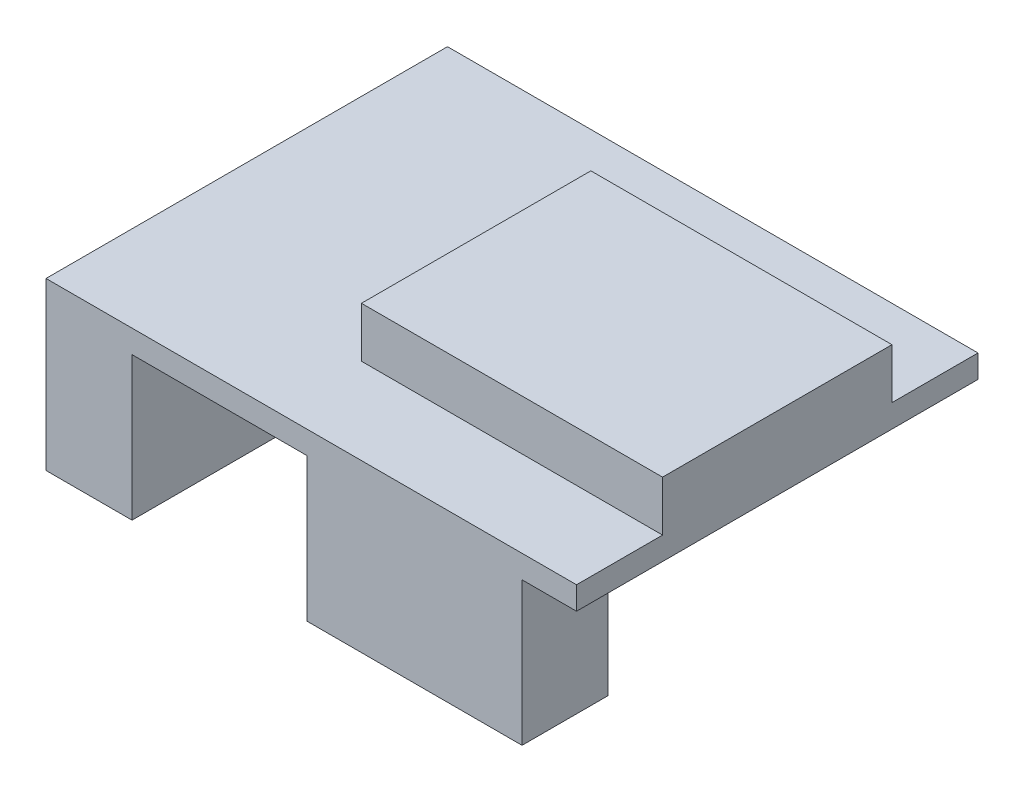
ISO-10303-21;
HEADER;
FILE_DESCRIPTION(('STEP AP214'),'2;1');
FILE_NAME('part.step','',(''),(''),'','','');
FILE_SCHEMA(('AUTOMOTIVE_DESIGN { 1 0 10303 214 1 1 1 1 }'));
ENDSEC;
DATA;
#1=APPLICATION_CONTEXT('core data for automotive mechanical design processes');
#2=APPLICATION_PROTOCOL_DEFINITION('international standard','automotive_design',2000,#1);
#3=PRODUCT_CONTEXT('',#1,'mechanical');
#4=PRODUCT('Part','Part','',(#3));
#5=PRODUCT_RELATED_PRODUCT_CATEGORY('part','',(#4));
#6=PRODUCT_DEFINITION_FORMATION('','',#4);
#7=PRODUCT_DEFINITION_CONTEXT('part definition',#1,'design');
#8=PRODUCT_DEFINITION('design','',#6,#7);
#9=PRODUCT_DEFINITION_SHAPE('','',#8);
#10=(LENGTH_UNIT() NAMED_UNIT(*) SI_UNIT(.MILLI.,.METRE.));
#11=(NAMED_UNIT(*) PLANE_ANGLE_UNIT() SI_UNIT($,.RADIAN.));
#12=(NAMED_UNIT(*) SI_UNIT($,.STERADIAN.) SOLID_ANGLE_UNIT());
#13=UNCERTAINTY_MEASURE_WITH_UNIT(LENGTH_MEASURE(1.E-05),#10,'distance_accuracy_value','');
#14=(GEOMETRIC_REPRESENTATION_CONTEXT(3) GLOBAL_UNCERTAINTY_ASSIGNED_CONTEXT((#13)) GLOBAL_UNIT_ASSIGNED_CONTEXT((#10,
#11,#12)) REPRESENTATION_CONTEXT('',''));
#15=CARTESIAN_POINT('',(0.,0.,0.));
#16=DIRECTION('',(0.,0.,1.));
#17=DIRECTION('',(1.,0.,0.));
#18=AXIS2_PLACEMENT_3D('',#15,#16,#17);
#19=CARTESIAN_POINT('',(0.,0.,0.));
#20=DIRECTION('',(0.,-1.,0.));
#21=DIRECTION('',(0.,0.,-1.));
#22=AXIS2_PLACEMENT_3D('',#19,#20,#21);
#23=PLANE('',#22);
#24=DIRECTION('',(-1.,0.,0.));
#25=VECTOR('',#24,1.);
#26=CARTESIAN_POINT('',(0.,0.,-6.58683240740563));
#27=LINE('',#26,#25);
#28=CARTESIAN_POINT('',(-12.5,0.,-6.58683240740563));
#29=VERTEX_POINT('',#28);
#30=CARTESIAN_POINT('',(-18.5,0.,-6.58683240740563));
#31=VERTEX_POINT('',#30);
#32=EDGE_CURVE('E180',#29,#31,#27,.T.);
#33=ORIENTED_EDGE('',*,*,#32,.F.);
#34=DIRECTION('',(0.,0.,1.));
#35=VECTOR('',#34,1.);
#36=CARTESIAN_POINT('',(-12.5,0.,0.));
#37=LINE('',#36,#35);
#38=CARTESIAN_POINT('',(-12.5,0.,-14.));
#39=VERTEX_POINT('',#38);
#40=EDGE_CURVE('E184',#39,#29,#37,.T.);
#41=ORIENTED_EDGE('',*,*,#40,.F.);
#42=DIRECTION('',(-1.,0.,0.));
#43=VECTOR('',#42,1.);
#44=CARTESIAN_POINT('',(-18.5,0.,-14.));
#45=LINE('',#44,#43);
#46=CARTESIAN_POINT('',(18.5,0.,-14.));
#47=VERTEX_POINT('',#46);
#48=EDGE_CURVE('E288',#47,#39,#45,.T.);
#49=ORIENTED_EDGE('',*,*,#48,.F.);
#50=DIRECTION('',(0.,0.,-1.));
#51=VECTOR('',#50,1.);
#52=CARTESIAN_POINT('',(18.5,0.,14.));
#53=LINE('',#52,#51);
#54=CARTESIAN_POINT('',(18.5,0.,14.));
#55=VERTEX_POINT('',#54);
#56=EDGE_CURVE('E275',#55,#47,#53,.T.);
#57=ORIENTED_EDGE('',*,*,#56,.F.);
#58=DIRECTION('',(1.,0.,0.));
#59=VECTOR('',#58,1.);
#60=CARTESIAN_POINT('',(-18.5,0.,14.));
#61=LINE('',#60,#59);
#62=CARTESIAN_POINT('',(14.7,0.,14.));
#63=VERTEX_POINT('',#62);
#64=EDGE_CURVE('E292',#63,#55,#61,.T.);
#65=ORIENTED_EDGE('',*,*,#64,.F.);
#66=DIRECTION('',(0.,0.,1.));
#67=VECTOR('',#66,1.);
#68=CARTESIAN_POINT('',(14.7,0.,0.));
#69=LINE('',#68,#67);
#70=CARTESIAN_POINT('',(14.7,0.,8.));
#71=VERTEX_POINT('',#70);
#72=EDGE_CURVE('E218',#71,#63,#69,.T.);
#73=ORIENTED_EDGE('',*,*,#72,.F.);
#74=DIRECTION('',(1.,0.,0.));
#75=VECTOR('',#74,1.);
#76=CARTESIAN_POINT('',(0.,0.,8.));
#77=LINE('',#76,#75);
#78=CARTESIAN_POINT('',(-0.299999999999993,0.,8.));
#79=VERTEX_POINT('',#78);
#80=EDGE_CURVE('E227',#79,#71,#77,.T.);
#81=ORIENTED_EDGE('',*,*,#80,.F.);
#82=DIRECTION('',(0.,0.,-1.));
#83=VECTOR('',#82,1.);
#84=CARTESIAN_POINT('',(-0.299999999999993,0.,0.));
#85=LINE('',#84,#83);
#86=CARTESIAN_POINT('',(-0.299999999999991,0.,14.));
#87=VERTEX_POINT('',#86);
#88=EDGE_CURVE('E213',#87,#79,#85,.T.);
#89=ORIENTED_EDGE('',*,*,#88,.F.);
#90=CARTESIAN_POINT('',(-12.5,0.,14.));
#91=VERTEX_POINT('',#90);
#92=EDGE_CURVE('E293',#91,#87,#61,.T.);
#93=ORIENTED_EDGE('',*,*,#92,.F.);
#94=DIRECTION('',(0.,0.,1.));
#95=VECTOR('',#94,1.);
#96=CARTESIAN_POINT('',(-12.5,0.,0.));
#97=LINE('',#96,#95);
#98=CARTESIAN_POINT('',(-12.5,0.,-1.));
#99=VERTEX_POINT('',#98);
#100=EDGE_CURVE('E186',#99,#91,#97,.T.);
#101=ORIENTED_EDGE('',*,*,#100,.F.);
#102=DIRECTION('',(1.,0.,0.));
#103=VECTOR('',#102,1.);
#104=CARTESIAN_POINT('',(0.,0.,-1.));
#105=LINE('',#104,#103);
#106=CARTESIAN_POINT('',(-18.5,0.,-1.));
#107=VERTEX_POINT('',#106);
#108=EDGE_CURVE('E189',#107,#99,#105,.T.);
#109=ORIENTED_EDGE('',*,*,#108,.F.);
#110=DIRECTION('',(0.,0.,1.));
#111=VECTOR('',#110,1.);
#112=CARTESIAN_POINT('',(-18.5,0.,14.));
#113=LINE('',#112,#111);
#114=EDGE_CURVE('E59',#31,#107,#113,.T.);
#115=ORIENTED_EDGE('',*,*,#114,.F.);
#116=EDGE_LOOP('',(#33,#41,#49,#57,#65,#73,#81,#89,#93,#101,#109,#115));
#117=FACE_BOUND('',#116,.T.);
#118=ADVANCED_FACE('F39',(#117),#23,.T.);
#119=CARTESIAN_POINT('',(0.,1.6,0.));
#120=DIRECTION('',(0.,-1.,0.));
#121=DIRECTION('',(0.,0.,-1.));
#122=AXIS2_PLACEMENT_3D('',#119,#120,#121);
#123=PLANE('',#122);
#124=DIRECTION('',(1.,0.,0.));
#125=VECTOR('',#124,1.);
#126=CARTESIAN_POINT('',(-2.5,1.6,8.));
#127=LINE('',#126,#125);
#128=CARTESIAN_POINT('',(-2.5,1.6,8.));
#129=VERTEX_POINT('',#128);
#130=CARTESIAN_POINT('',(18.5,1.6,8.));
#131=VERTEX_POINT('',#130);
#132=EDGE_CURVE('E248',#129,#131,#127,.T.);
#133=ORIENTED_EDGE('',*,*,#132,.F.);
#134=DIRECTION('',(0.,0.,1.));
#135=VECTOR('',#134,1.);
#136=CARTESIAN_POINT('',(-2.5,1.6,-8.));
#137=LINE('',#136,#135);
#138=CARTESIAN_POINT('',(-2.5,1.6,-8.));
#139=VERTEX_POINT('',#138);
#140=EDGE_CURVE('E258',#139,#129,#137,.T.);
#141=ORIENTED_EDGE('',*,*,#140,.F.);
#142=DIRECTION('',(-1.,0.,0.));
#143=VECTOR('',#142,1.);
#144=CARTESIAN_POINT('',(-2.5,1.6,-8.));
#145=LINE('',#144,#143);
#146=CARTESIAN_POINT('',(18.5,1.6,-8.));
#147=VERTEX_POINT('',#146);
#148=EDGE_CURVE('E243',#147,#139,#145,.T.);
#149=ORIENTED_EDGE('',*,*,#148,.F.);
#150=DIRECTION('',(0.,0.,-1.));
#151=VECTOR('',#150,1.);
#152=CARTESIAN_POINT('',(18.5,1.6,14.));
#153=LINE('',#152,#151);
#154=CARTESIAN_POINT('',(18.5,1.6,-14.));
#155=VERTEX_POINT('',#154);
#156=EDGE_CURVE('E279',#147,#155,#153,.T.);
#157=ORIENTED_EDGE('',*,*,#156,.T.);
#158=DIRECTION('',(-1.,0.,0.));
#159=VECTOR('',#158,1.);
#160=CARTESIAN_POINT('',(-18.5,1.6,-14.));
#161=LINE('',#160,#159);
#162=CARTESIAN_POINT('',(-18.5,1.6,-14.));
#163=VERTEX_POINT('',#162);
#164=EDGE_CURVE('E278',#155,#163,#161,.T.);
#165=ORIENTED_EDGE('',*,*,#164,.T.);
#166=DIRECTION('',(0.,0.,1.));
#167=VECTOR('',#166,1.);
#168=CARTESIAN_POINT('',(-18.5,1.6,14.));
#169=LINE('',#168,#167);
#170=CARTESIAN_POINT('',(-18.5,1.6,14.));
#171=VERTEX_POINT('',#170);
#172=EDGE_CURVE('E281',#163,#171,#169,.T.);
#173=ORIENTED_EDGE('',*,*,#172,.T.);
#174=DIRECTION('',(1.,0.,0.));
#175=VECTOR('',#174,1.);
#176=CARTESIAN_POINT('',(-18.5,1.6,14.));
#177=LINE('',#176,#175);
#178=CARTESIAN_POINT('',(18.5,1.6,14.));
#179=VERTEX_POINT('',#178);
#180=EDGE_CURVE('E283',#171,#179,#177,.T.);
#181=ORIENTED_EDGE('',*,*,#180,.T.);
#182=EDGE_CURVE('E276',#179,#131,#153,.T.);
#183=ORIENTED_EDGE('',*,*,#182,.T.);
#184=EDGE_LOOP('',(#133,#141,#149,#157,#165,#173,#181,#183));
#185=FACE_BOUND('',#184,.T.);
#186=ADVANCED_FACE('F330',(#185),#123,.F.);
#187=CARTESIAN_POINT('',(18.5,1.6,14.));
#188=DIRECTION('',(-1.,0.,0.));
#189=DIRECTION('',(0.,0.,1.));
#190=AXIS2_PLACEMENT_3D('',#187,#188,#189);
#191=PLANE('',#190);
#192=ORIENTED_EDGE('',*,*,#56,.T.);
#193=DIRECTION('',(0.,-1.,0.));
#194=VECTOR('',#193,1.);
#195=CARTESIAN_POINT('',(18.5,1.6,-14.));
#196=LINE('',#195,#194);
#197=EDGE_CURVE('E11',#155,#47,#196,.T.);
#198=ORIENTED_EDGE('',*,*,#197,.F.);
#199=ORIENTED_EDGE('',*,*,#156,.F.);
#200=DIRECTION('',(0.,-1.,0.));
#201=VECTOR('',#200,1.);
#202=CARTESIAN_POINT('',(18.5,5.1,-8.));
#203=LINE('',#202,#201);
#204=CARTESIAN_POINT('',(18.5,5.1,-8.));
#205=VERTEX_POINT('',#204);
#206=EDGE_CURVE('E272',#205,#147,#203,.T.);
#207=ORIENTED_EDGE('',*,*,#206,.F.);
#208=DIRECTION('',(0.,0.,-1.));
#209=VECTOR('',#208,1.);
#210=CARTESIAN_POINT('',(18.5,5.1,-8.));
#211=LINE('',#210,#209);
#212=CARTESIAN_POINT('',(18.5,5.1,8.));
#213=VERTEX_POINT('',#212);
#214=EDGE_CURVE('E244',#213,#205,#211,.T.);
#215=ORIENTED_EDGE('',*,*,#214,.F.);
#216=DIRECTION('',(0.,-1.,0.));
#217=VECTOR('',#216,1.);
#218=CARTESIAN_POINT('',(18.5,5.1,8.));
#219=LINE('',#218,#217);
#220=EDGE_CURVE('E255',#213,#131,#219,.T.);
#221=ORIENTED_EDGE('',*,*,#220,.T.);
#222=ORIENTED_EDGE('',*,*,#182,.F.);
#223=DIRECTION('',(0.,-1.,0.));
#224=VECTOR('',#223,1.);
#225=CARTESIAN_POINT('',(18.5,1.6,14.));
#226=LINE('',#225,#224);
#227=EDGE_CURVE('E285',#179,#55,#226,.T.);
#228=ORIENTED_EDGE('',*,*,#227,.T.);
#229=EDGE_LOOP('',(#192,#198,#199,#207,#215,#221,#222,#228));
#230=FACE_BOUND('',#229,.T.);
#231=ADVANCED_FACE('F41',(#230),#191,.F.);
#232=CARTESIAN_POINT('',(-18.5,1.6,-14.));
#233=DIRECTION('',(0.,0.,1.));
#234=DIRECTION('',(1.,0.,0.));
#235=AXIS2_PLACEMENT_3D('',#232,#233,#234);
#236=PLANE('',#235);
#237=ORIENTED_EDGE('',*,*,#48,.T.);
#238=DIRECTION('',(0.,1.,0.));
#239=VECTOR('',#238,1.);
#240=CARTESIAN_POINT('',(-12.5,-10.,-14.));
#241=LINE('',#240,#239);
#242=CARTESIAN_POINT('',(-12.5,-10.,-14.));
#243=VERTEX_POINT('',#242);
#244=EDGE_CURVE('E191',#243,#39,#241,.T.);
#245=ORIENTED_EDGE('',*,*,#244,.F.);
#246=DIRECTION('',(1.,0.,0.));
#247=VECTOR('',#246,1.);
#248=CARTESIAN_POINT('',(0.,-10.,-14.));
#249=LINE('',#248,#247);
#250=CARTESIAN_POINT('',(-18.5,-10.,-14.));
#251=VERTEX_POINT('',#250);
#252=EDGE_CURVE('E177',#251,#243,#249,.T.);
#253=ORIENTED_EDGE('',*,*,#252,.F.);
#254=DIRECTION('',(0.,-1.,0.));
#255=VECTOR('',#254,1.);
#256=CARTESIAN_POINT('',(-18.5,1.6,-14.));
#257=LINE('',#256,#255);
#258=EDGE_CURVE('E47',#163,#251,#257,.T.);
#259=ORIENTED_EDGE('',*,*,#258,.F.);
#260=ORIENTED_EDGE('',*,*,#164,.F.);
#261=ORIENTED_EDGE('',*,*,#197,.T.);
#262=EDGE_LOOP('',(#237,#245,#253,#259,#260,#261));
#263=FACE_BOUND('',#262,.T.);
#264=ADVANCED_FACE('F305',(#263),#236,.F.);
#265=CARTESIAN_POINT('',(-18.5,1.6,14.));
#266=DIRECTION('',(1.,0.,0.));
#267=DIRECTION('',(0.,0.,-1.));
#268=AXIS2_PLACEMENT_3D('',#265,#266,#267);
#269=PLANE('',#268);
#270=ORIENTED_EDGE('',*,*,#258,.T.);
#271=DIRECTION('',(0.,0.,-1.));
#272=VECTOR('',#271,1.);
#273=CARTESIAN_POINT('',(-18.5,-10.,0.));
#274=LINE('',#273,#272);
#275=CARTESIAN_POINT('',(-18.5,-10.,-6.58683240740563));
#276=VERTEX_POINT('',#275);
#277=EDGE_CURVE('E171',#276,#251,#274,.T.);
#278=ORIENTED_EDGE('',*,*,#277,.F.);
#279=DIRECTION('',(0.,1.,0.));
#280=VECTOR('',#279,1.);
#281=CARTESIAN_POINT('',(-18.5,-10.,-6.58683240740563));
#282=LINE('',#281,#280);
#283=EDGE_CURVE('E54',#276,#31,#282,.T.);
#284=ORIENTED_EDGE('',*,*,#283,.T.);
#285=ORIENTED_EDGE('',*,*,#114,.T.);
#286=DIRECTION('',(0.,1.,0.));
#287=VECTOR('',#286,1.);
#288=CARTESIAN_POINT('',(-18.5,-10.,-1.));
#289=LINE('',#288,#287);
#290=CARTESIAN_POINT('',(-18.5,-10.,-1.));
#291=VERTEX_POINT('',#290);
#292=EDGE_CURVE('E209',#291,#107,#289,.T.);
#293=ORIENTED_EDGE('',*,*,#292,.F.);
#294=DIRECTION('',(0.,0.,-1.));
#295=VECTOR('',#294,1.);
#296=CARTESIAN_POINT('',(-18.5,-10.,0.));
#297=LINE('',#296,#295);
#298=CARTESIAN_POINT('',(-18.5,-10.,14.));
#299=VERTEX_POINT('',#298);
#300=EDGE_CURVE('E201',#299,#291,#297,.T.);
#301=ORIENTED_EDGE('',*,*,#300,.F.);
#302=DIRECTION('',(0.,-1.,0.));
#303=VECTOR('',#302,1.);
#304=CARTESIAN_POINT('',(-18.5,1.6,14.));
#305=LINE('',#304,#303);
#306=EDGE_CURVE('E297',#171,#299,#305,.T.);
#307=ORIENTED_EDGE('',*,*,#306,.F.);
#308=ORIENTED_EDGE('',*,*,#172,.F.);
#309=EDGE_LOOP('',(#270,#278,#284,#285,#293,#301,#307,#308));
#310=FACE_BOUND('',#309,.T.);
#311=ADVANCED_FACE('F300',(#310),#269,.F.);
#312=CARTESIAN_POINT('',(-18.5,1.6,14.));
#313=DIRECTION('',(0.,0.,-1.));
#314=DIRECTION('',(-1.,0.,0.));
#315=AXIS2_PLACEMENT_3D('',#312,#313,#314);
#316=PLANE('',#315);
#317=ORIENTED_EDGE('',*,*,#306,.T.);
#318=DIRECTION('',(-1.,0.,0.));
#319=VECTOR('',#318,1.);
#320=CARTESIAN_POINT('',(0.,-10.,14.));
#321=LINE('',#320,#319);
#322=CARTESIAN_POINT('',(-12.5,-10.,14.));
#323=VERTEX_POINT('',#322);
#324=EDGE_CURVE('E198',#323,#299,#321,.T.);
#325=ORIENTED_EDGE('',*,*,#324,.F.);
#326=DIRECTION('',(0.,1.,0.));
#327=VECTOR('',#326,1.);
#328=CARTESIAN_POINT('',(-12.5,-10.,14.));
#329=LINE('',#328,#327);
#330=EDGE_CURVE('E211',#323,#91,#329,.T.);
#331=ORIENTED_EDGE('',*,*,#330,.T.);
#332=ORIENTED_EDGE('',*,*,#92,.T.);
#333=DIRECTION('',(0.,1.,0.));
#334=VECTOR('',#333,1.);
#335=CARTESIAN_POINT('',(-0.299999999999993,-10.,14.));
#336=LINE('',#335,#334);
#337=CARTESIAN_POINT('',(-0.299999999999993,-10.,14.));
#338=VERTEX_POINT('',#337);
#339=EDGE_CURVE('E240',#338,#87,#336,.T.);
#340=ORIENTED_EDGE('',*,*,#339,.F.);
#341=DIRECTION('',(-1.,0.,0.));
#342=VECTOR('',#341,1.);
#343=CARTESIAN_POINT('',(0.,-10.,14.));
#344=LINE('',#343,#342);
#345=CARTESIAN_POINT('',(14.7,-10.,14.));
#346=VERTEX_POINT('',#345);
#347=EDGE_CURVE('E214',#346,#338,#344,.T.);
#348=ORIENTED_EDGE('',*,*,#347,.F.);
#349=DIRECTION('',(0.,1.,0.));
#350=VECTOR('',#349,1.);
#351=CARTESIAN_POINT('',(14.7,-10.,14.));
#352=LINE('',#351,#350);
#353=EDGE_CURVE('E224',#346,#63,#352,.T.);
#354=ORIENTED_EDGE('',*,*,#353,.T.);
#355=ORIENTED_EDGE('',*,*,#64,.T.);
#356=ORIENTED_EDGE('',*,*,#227,.F.);
#357=ORIENTED_EDGE('',*,*,#180,.F.);
#358=EDGE_LOOP('',(#317,#325,#331,#332,#340,#348,#354,#355,#356,#357));
#359=FACE_BOUND('',#358,.T.);
#360=ADVANCED_FACE('F327',(#359),#316,.F.);
#361=CARTESIAN_POINT('',(-2.5,5.1,-8.));
#362=DIRECTION('',(0.,0.,1.));
#363=DIRECTION('',(1.,0.,0.));
#364=AXIS2_PLACEMENT_3D('',#361,#362,#363);
#365=PLANE('',#364);
#366=ORIENTED_EDGE('',*,*,#148,.T.);
#367=DIRECTION('',(0.,-1.,0.));
#368=VECTOR('',#367,1.);
#369=CARTESIAN_POINT('',(-2.5,5.1,-8.));
#370=LINE('',#369,#368);
#371=CARTESIAN_POINT('',(-2.5,5.1,-8.));
#372=VERTEX_POINT('',#371);
#373=EDGE_CURVE('E269',#372,#139,#370,.T.);
#374=ORIENTED_EDGE('',*,*,#373,.F.);
#375=DIRECTION('',(-1.,0.,0.));
#376=VECTOR('',#375,1.);
#377=CARTESIAN_POINT('',(-2.5,5.1,-8.));
#378=LINE('',#377,#376);
#379=EDGE_CURVE('E247',#205,#372,#378,.T.);
#380=ORIENTED_EDGE('',*,*,#379,.F.);
#381=ORIENTED_EDGE('',*,*,#206,.T.);
#382=EDGE_LOOP('',(#366,#374,#380,#381));
#383=FACE_BOUND('',#382,.T.);
#384=ADVANCED_FACE('F373',(#383),#365,.F.);
#385=CARTESIAN_POINT('',(-2.5,5.1,-8.));
#386=DIRECTION('',(1.,0.,0.));
#387=DIRECTION('',(0.,0.,-1.));
#388=AXIS2_PLACEMENT_3D('',#385,#386,#387);
#389=PLANE('',#388);
#390=ORIENTED_EDGE('',*,*,#140,.T.);
#391=DIRECTION('',(0.,-1.,0.));
#392=VECTOR('',#391,1.);
#393=CARTESIAN_POINT('',(-2.5,5.1,8.));
#394=LINE('',#393,#392);
#395=CARTESIAN_POINT('',(-2.5,5.1,8.));
#396=VERTEX_POINT('',#395);
#397=EDGE_CURVE('E266',#396,#129,#394,.T.);
#398=ORIENTED_EDGE('',*,*,#397,.F.);
#399=DIRECTION('',(0.,0.,1.));
#400=VECTOR('',#399,1.);
#401=CARTESIAN_POINT('',(-2.5,5.1,-8.));
#402=LINE('',#401,#400);
#403=EDGE_CURVE('E250',#372,#396,#402,.T.);
#404=ORIENTED_EDGE('',*,*,#403,.F.);
#405=ORIENTED_EDGE('',*,*,#373,.T.);
#406=EDGE_LOOP('',(#390,#398,#404,#405));
#407=FACE_BOUND('',#406,.T.);
#408=ADVANCED_FACE('F415',(#407),#389,.F.);
#409=CARTESIAN_POINT('',(-2.5,5.1,8.));
#410=DIRECTION('',(0.,0.,-1.));
#411=DIRECTION('',(-1.,0.,0.));
#412=AXIS2_PLACEMENT_3D('',#409,#410,#411);
#413=PLANE('',#412);
#414=ORIENTED_EDGE('',*,*,#132,.T.);
#415=ORIENTED_EDGE('',*,*,#220,.F.);
#416=DIRECTION('',(1.,0.,0.));
#417=VECTOR('',#416,1.);
#418=CARTESIAN_POINT('',(-2.5,5.1,8.));
#419=LINE('',#418,#417);
#420=EDGE_CURVE('E253',#396,#213,#419,.T.);
#421=ORIENTED_EDGE('',*,*,#420,.F.);
#422=ORIENTED_EDGE('',*,*,#397,.T.);
#423=EDGE_LOOP('',(#414,#415,#421,#422));
#424=FACE_BOUND('',#423,.T.);
#425=ADVANCED_FACE('F360',(#424),#413,.F.);
#426=CARTESIAN_POINT('',(0.,5.1,0.));
#427=DIRECTION('',(0.,1.,0.));
#428=DIRECTION('',(0.,0.,1.));
#429=AXIS2_PLACEMENT_3D('',#426,#427,#428);
#430=PLANE('',#429);
#431=ORIENTED_EDGE('',*,*,#214,.T.);
#432=ORIENTED_EDGE('',*,*,#379,.T.);
#433=ORIENTED_EDGE('',*,*,#403,.T.);
#434=ORIENTED_EDGE('',*,*,#420,.T.);
#435=EDGE_LOOP('',(#431,#432,#433,#434));
#436=FACE_BOUND('',#435,.T.);
#437=ADVANCED_FACE('F353',(#436),#430,.T.);
#438=CARTESIAN_POINT('',(-0.299999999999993,-10.,0.));
#439=DIRECTION('',(1.,0.,0.));
#440=DIRECTION('',(0.,0.,-1.));
#441=AXIS2_PLACEMENT_3D('',#438,#439,#440);
#442=PLANE('',#441);
#443=ORIENTED_EDGE('',*,*,#88,.T.);
#444=DIRECTION('',(0.,1.,0.));
#445=VECTOR('',#444,1.);
#446=CARTESIAN_POINT('',(-0.299999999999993,-10.,8.));
#447=LINE('',#446,#445);
#448=CARTESIAN_POINT('',(-0.299999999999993,-10.,8.));
#449=VERTEX_POINT('',#448);
#450=EDGE_CURVE('E237',#449,#79,#447,.T.);
#451=ORIENTED_EDGE('',*,*,#450,.F.);
#452=DIRECTION('',(0.,0.,-1.));
#453=VECTOR('',#452,1.);
#454=CARTESIAN_POINT('',(-0.299999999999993,-10.,0.));
#455=LINE('',#454,#453);
#456=EDGE_CURVE('E217',#338,#449,#455,.T.);
#457=ORIENTED_EDGE('',*,*,#456,.F.);
#458=ORIENTED_EDGE('',*,*,#339,.T.);
#459=EDGE_LOOP('',(#443,#451,#457,#458));
#460=FACE_BOUND('',#459,.T.);
#461=ADVANCED_FACE('F351',(#460),#442,.F.);
#462=CARTESIAN_POINT('',(0.,-10.,8.));
#463=DIRECTION('',(0.,0.,1.));
#464=DIRECTION('',(1.,0.,0.));
#465=AXIS2_PLACEMENT_3D('',#462,#463,#464);
#466=PLANE('',#465);
#467=ORIENTED_EDGE('',*,*,#80,.T.);
#468=DIRECTION('',(0.,1.,0.));
#469=VECTOR('',#468,1.);
#470=CARTESIAN_POINT('',(14.7,-10.,8.));
#471=LINE('',#470,#469);
#472=CARTESIAN_POINT('',(14.7,-10.,8.));
#473=VERTEX_POINT('',#472);
#474=EDGE_CURVE('E234',#473,#71,#471,.T.);
#475=ORIENTED_EDGE('',*,*,#474,.F.);
#476=DIRECTION('',(1.,0.,0.));
#477=VECTOR('',#476,1.);
#478=CARTESIAN_POINT('',(0.,-10.,8.));
#479=LINE('',#478,#477);
#480=EDGE_CURVE('E220',#449,#473,#479,.T.);
#481=ORIENTED_EDGE('',*,*,#480,.F.);
#482=ORIENTED_EDGE('',*,*,#450,.T.);
#483=EDGE_LOOP('',(#467,#475,#481,#482));
#484=FACE_BOUND('',#483,.T.);
#485=ADVANCED_FACE('F348',(#484),#466,.F.);
#486=CARTESIAN_POINT('',(14.7,-10.,0.));
#487=DIRECTION('',(-1.,0.,0.));
#488=DIRECTION('',(0.,0.,1.));
#489=AXIS2_PLACEMENT_3D('',#486,#487,#488);
#490=PLANE('',#489);
#491=ORIENTED_EDGE('',*,*,#72,.T.);
#492=ORIENTED_EDGE('',*,*,#353,.F.);
#493=DIRECTION('',(0.,0.,1.));
#494=VECTOR('',#493,1.);
#495=CARTESIAN_POINT('',(14.7,-10.,0.));
#496=LINE('',#495,#494);
#497=EDGE_CURVE('E222',#473,#346,#496,.T.);
#498=ORIENTED_EDGE('',*,*,#497,.F.);
#499=ORIENTED_EDGE('',*,*,#474,.T.);
#500=EDGE_LOOP('',(#491,#492,#498,#499));
#501=FACE_BOUND('',#500,.T.);
#502=ADVANCED_FACE('F338',(#501),#490,.F.);
#503=CARTESIAN_POINT('',(0.,-10.,0.));
#504=DIRECTION('',(0.,-1.,0.));
#505=DIRECTION('',(0.,0.,-1.));
#506=AXIS2_PLACEMENT_3D('',#503,#504,#505);
#507=PLANE('',#506);
#508=ORIENTED_EDGE('',*,*,#347,.T.);
#509=ORIENTED_EDGE('',*,*,#456,.T.);
#510=ORIENTED_EDGE('',*,*,#480,.T.);
#511=ORIENTED_EDGE('',*,*,#497,.T.);
#512=EDGE_LOOP('',(#508,#509,#510,#511));
#513=FACE_BOUND('',#512,.T.);
#514=ADVANCED_FACE('F344',(#513),#507,.T.);
#515=CARTESIAN_POINT('',(-12.5,-10.,0.));
#516=DIRECTION('',(-1.,0.,0.));
#517=DIRECTION('',(0.,0.,1.));
#518=AXIS2_PLACEMENT_3D('',#515,#516,#517);
#519=PLANE('',#518);
#520=ORIENTED_EDGE('',*,*,#100,.T.);
#521=ORIENTED_EDGE('',*,*,#330,.F.);
#522=DIRECTION('',(0.,0.,1.));
#523=VECTOR('',#522,1.);
#524=CARTESIAN_POINT('',(-12.5,-10.,0.));
#525=LINE('',#524,#523);
#526=CARTESIAN_POINT('',(-12.5,-10.,-1.));
#527=VERTEX_POINT('',#526);
#528=EDGE_CURVE('E195',#527,#323,#525,.T.);
#529=ORIENTED_EDGE('',*,*,#528,.F.);
#530=DIRECTION('',(0.,1.,0.));
#531=VECTOR('',#530,1.);
#532=CARTESIAN_POINT('',(-12.5,-10.,-1.));
#533=LINE('',#532,#531);
#534=EDGE_CURVE('E204',#527,#99,#533,.T.);
#535=ORIENTED_EDGE('',*,*,#534,.T.);
#536=EDGE_LOOP('',(#520,#521,#529,#535));
#537=FACE_BOUND('',#536,.T.);
#538=ADVANCED_FACE('F319',(#537),#519,.F.);
#539=CARTESIAN_POINT('',(0.,-10.,-1.));
#540=DIRECTION('',(0.,0.,1.));
#541=DIRECTION('',(1.,0.,0.));
#542=AXIS2_PLACEMENT_3D('',#539,#540,#541);
#543=PLANE('',#542);
#544=ORIENTED_EDGE('',*,*,#108,.T.);
#545=ORIENTED_EDGE('',*,*,#534,.F.);
#546=DIRECTION('',(1.,0.,0.));
#547=VECTOR('',#546,1.);
#548=CARTESIAN_POINT('',(0.,-10.,-1.));
#549=LINE('',#548,#547);
#550=EDGE_CURVE('E203',#291,#527,#549,.T.);
#551=ORIENTED_EDGE('',*,*,#550,.F.);
#552=ORIENTED_EDGE('',*,*,#292,.T.);
#553=EDGE_LOOP('',(#544,#545,#551,#552));
#554=FACE_BOUND('',#553,.T.);
#555=ADVANCED_FACE('F315',(#554),#543,.F.);
#556=CARTESIAN_POINT('',(0.,-10.,0.));
#557=DIRECTION('',(0.,-1.,0.));
#558=DIRECTION('',(0.,0.,-1.));
#559=AXIS2_PLACEMENT_3D('',#556,#557,#558);
#560=PLANE('',#559);
#561=ORIENTED_EDGE('',*,*,#528,.T.);
#562=ORIENTED_EDGE('',*,*,#324,.T.);
#563=ORIENTED_EDGE('',*,*,#300,.T.);
#564=ORIENTED_EDGE('',*,*,#550,.T.);
#565=EDGE_LOOP('',(#561,#562,#563,#564));
#566=FACE_BOUND('',#565,.T.);
#567=ADVANCED_FACE('F322',(#566),#560,.T.);
#568=CARTESIAN_POINT('',(-12.5,-10.,0.));
#569=DIRECTION('',(-1.,0.,0.));
#570=DIRECTION('',(0.,0.,1.));
#571=AXIS2_PLACEMENT_3D('',#568,#569,#570);
#572=PLANE('',#571);
#573=ORIENTED_EDGE('',*,*,#40,.T.);
#574=DIRECTION('',(0.,1.,0.));
#575=VECTOR('',#574,1.);
#576=CARTESIAN_POINT('',(-12.5,-10.,-6.58683240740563));
#577=LINE('',#576,#575);
#578=CARTESIAN_POINT('',(-12.5,-10.,-6.58683240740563));
#579=VERTEX_POINT('',#578);
#580=EDGE_CURVE('E167',#579,#29,#577,.T.);
#581=ORIENTED_EDGE('',*,*,#580,.F.);
#582=DIRECTION('',(0.,0.,1.));
#583=VECTOR('',#582,1.);
#584=CARTESIAN_POINT('',(-12.5,-10.,0.));
#585=LINE('',#584,#583);
#586=EDGE_CURVE('E172',#243,#579,#585,.T.);
#587=ORIENTED_EDGE('',*,*,#586,.F.);
#588=ORIENTED_EDGE('',*,*,#244,.T.);
#589=EDGE_LOOP('',(#573,#581,#587,#588));
#590=FACE_BOUND('',#589,.T.);
#591=ADVANCED_FACE('F182',(#590),#572,.F.);
#592=CARTESIAN_POINT('',(0.,-10.,-6.58683240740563));
#593=DIRECTION('',(0.,0.,-1.));
#594=DIRECTION('',(-1.,0.,0.));
#595=AXIS2_PLACEMENT_3D('',#592,#593,#594);
#596=PLANE('',#595);
#597=ORIENTED_EDGE('',*,*,#32,.T.);
#598=ORIENTED_EDGE('',*,*,#283,.F.);
#599=DIRECTION('',(-1.,0.,0.));
#600=VECTOR('',#599,1.);
#601=CARTESIAN_POINT('',(0.,-10.,-6.58683240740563));
#602=LINE('',#601,#600);
#603=EDGE_CURVE('E163',#579,#276,#602,.T.);
#604=ORIENTED_EDGE('',*,*,#603,.F.);
#605=ORIENTED_EDGE('',*,*,#580,.T.);
#606=EDGE_LOOP('',(#597,#598,#604,#605));
#607=FACE_BOUND('',#606,.T.);
#608=ADVANCED_FACE('F165',(#607),#596,.F.);
#609=CARTESIAN_POINT('',(0.,-10.,0.));
#610=DIRECTION('',(0.,-1.,0.));
#611=DIRECTION('',(0.,0.,-1.));
#612=AXIS2_PLACEMENT_3D('',#609,#610,#611);
#613=PLANE('',#612);
#614=ORIENTED_EDGE('',*,*,#586,.T.);
#615=ORIENTED_EDGE('',*,*,#603,.T.);
#616=ORIENTED_EDGE('',*,*,#277,.T.);
#617=ORIENTED_EDGE('',*,*,#252,.T.);
#618=EDGE_LOOP('',(#614,#615,#616,#617));
#619=FACE_BOUND('',#618,.T.);
#620=ADVANCED_FACE('F175',(#619),#613,.T.);
#621=CLOSED_SHELL('',(#118,#186,#231,#264,#311,#360,#384,#408,#425,#437,#461,#485,#502,#514,
#538,#555,#567,#591,#608,#620));
#622=MANIFOLD_SOLID_BREP('B2',#621);
#623=ADVANCED_BREP_SHAPE_REPRESENTATION('',(#18,#622),#14);
#624=SHAPE_DEFINITION_REPRESENTATION(#9,#623);
ENDSEC;
END-ISO-10303-21;
